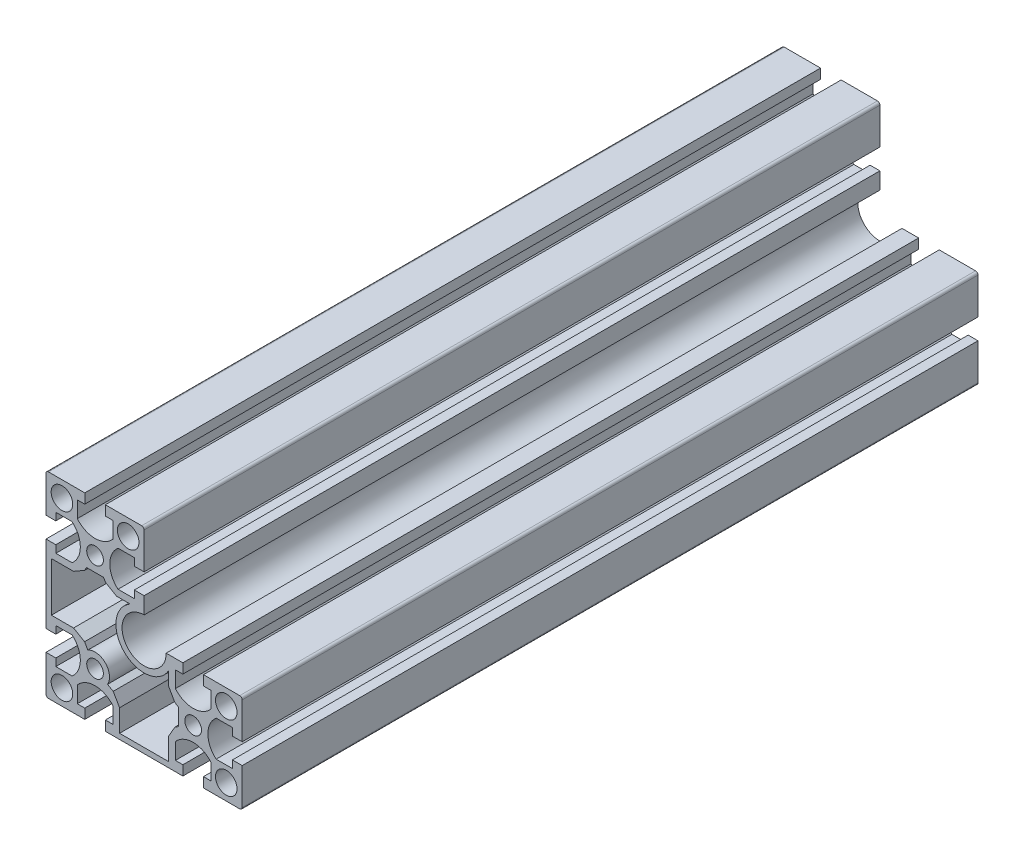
from build123d import *

# Parameters (mm, degrees)
MODEL_R         = 4.4
MODEL_R_2       = 3.4
EXTRUDE_1_DEPTH = 300


with BuildPart() as part:
    # Model → Extrude 1 (new body)
    with BuildSketch(Plane.XY):
        with BuildLine():
            Line((1530.933788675, 813.784756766), (1533.983788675, 813.784756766))
            Line((1533.983788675, 813.784756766), (1533.983788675, 817.784756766))
            Line((1533.983788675, 817.784756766), (1527.183788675, 817.784756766))
            ThreePointArc((1527.183788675, 817.784756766), (1511.819827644, 811.420795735), (1518.183788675, 826.784756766))
            Line((1518.183788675, 826.784756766), (1518.183788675, 833.584756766))
            Line((1518.183788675, 833.584756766), (1514.183788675, 833.584756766))
            Line((1514.183788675, 833.584756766), (1514.183788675, 830.534756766))
            Line((1514.183788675, 830.534756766), (1507.544774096, 830.534756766))
            ThreePointArc((1507.544774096, 830.534756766), (1504.183788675, 837.784756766), (1507.544774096, 845.034756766))
            Line((1507.544774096, 845.034756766), (1514.183788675, 845.034756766))
            Line((1514.183788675, 845.034756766), (1514.183788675, 841.984756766))
            Line((1514.183788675, 841.984756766), (1518.183788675, 841.984756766))
            Line((1518.183788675, 841.984756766), (1518.183788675, 856.784756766))
            ThreePointArc((1518.183788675, 856.784756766), (1517.890895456, 857.491863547), (1517.183788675, 857.784756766))
            Line((1517.183788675, 857.784756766), (1502.383788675, 857.784756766))
            Line((1502.383788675, 857.784756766), (1502.383788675, 853.784756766))
            Line((1502.383788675, 853.784756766), (1505.433788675, 853.784756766))
            Line((1505.433788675, 853.784756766), (1505.433788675, 847.145742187))
            ThreePointArc((1505.433788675, 847.145742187), (1498.183788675, 843.784756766), (1490.933788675, 847.145742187))
            Line((1490.933788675, 847.145742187), (1490.933788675, 853.784756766))
            Line((1490.933788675, 853.784756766), (1493.983788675, 853.784756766))
            Line((1493.983788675, 853.784756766), (1493.983788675, 857.784756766))
            Line((1493.983788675, 857.784756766), (1479.183788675, 857.784756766))
            ThreePointArc((1479.183788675, 857.784756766), (1478.476681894, 857.491863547), (1478.183788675, 856.784756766))
            Line((1478.183788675, 856.784756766), (1478.183788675, 841.984756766))
            Line((1478.183788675, 841.984756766), (1482.183788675, 841.984756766))
            Line((1482.183788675, 841.984756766), (1482.183788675, 845.034756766))
            Line((1482.183788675, 845.034756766), (1488.822803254, 845.034756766))
            ThreePointArc((1488.822803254, 845.034756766), (1492.183788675, 837.784756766), (1488.822803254, 830.534756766))
            Line((1488.822803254, 830.534756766), (1482.183788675, 830.534756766))
            Line((1482.183788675, 830.534756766), (1482.183788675, 833.584756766))
            Line((1482.183788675, 833.584756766), (1478.183788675, 833.584756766))
            Line((1478.183788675, 833.584756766), (1478.183788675, 801.984756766))
            Line((1478.183788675, 801.984756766), (1482.183788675, 801.984756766))
            Line((1482.183788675, 801.984756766), (1482.183788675, 805.034756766))
            Line((1482.183788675, 805.034756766), (1488.822803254, 805.034756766))
            ThreePointArc((1488.822803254, 805.034756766), (1492.183788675, 797.784756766), (1488.822803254, 790.534756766))
            Line((1488.822803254, 790.534756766), (1482.183788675, 790.534756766))
            Line((1482.183788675, 790.534756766), (1482.183788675, 793.584756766))
            Line((1482.183788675, 793.584756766), (1478.183788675, 793.584756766))
            Line((1478.183788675, 793.584756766), (1478.183788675, 778.784756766))
            ThreePointArc((1478.183788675, 778.784756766), (1478.476681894, 778.077649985), (1479.183788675, 777.784756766))
            Line((1479.183788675, 777.784756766), (1493.983788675, 777.784756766))
            Line((1493.983788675, 777.784756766), (1493.983788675, 781.784756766))
            Line((1493.983788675, 781.784756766), (1490.933788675, 781.784756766))
            Line((1490.933788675, 781.784756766), (1490.933788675, 788.423771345))
            ThreePointArc((1490.933788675, 788.423771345), (1498.183788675, 791.784756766), (1505.433788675, 788.423771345))
            Line((1505.433788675, 788.423771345), (1505.433788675, 781.784756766))
            Line((1505.433788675, 781.784756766), (1502.383788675, 781.784756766))
            Line((1502.383788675, 781.784756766), (1502.383788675, 777.784756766))
            Line((1502.383788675, 777.784756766), (1533.983788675, 777.784756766))
            Line((1533.983788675, 777.784756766), (1533.983788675, 781.784756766))
            Line((1533.983788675, 781.784756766), (1530.933788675, 781.784756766))
            Line((1530.933788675, 781.784756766), (1530.933788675, 788.423771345))
            ThreePointArc((1530.933788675, 788.423771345), (1538.183788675, 791.784756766), (1545.433788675, 788.423771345))
            Line((1545.433788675, 788.423771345), (1545.433788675, 781.784756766))
            Line((1545.433788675, 781.784756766), (1542.383788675, 781.784756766))
            Line((1542.383788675, 781.784756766), (1542.383788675, 777.784756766))
            Line((1542.383788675, 777.784756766), (1557.183788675, 777.784756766))
            ThreePointArc((1557.183788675, 777.784756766), (1557.890895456, 778.077649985), (1558.183788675, 778.784756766))
            Line((1558.183788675, 778.784756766), (1558.183788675, 793.584756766))
            Line((1558.183788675, 793.584756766), (1554.183788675, 793.584756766))
            Line((1554.183788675, 793.584756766), (1554.183788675, 790.534756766))
            Line((1554.183788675, 790.534756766), (1547.544774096, 790.534756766))
            ThreePointArc((1547.544774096, 790.534756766), (1544.183788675, 797.784756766), (1547.544774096, 805.034756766))
            Line((1547.544774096, 805.034756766), (1554.183788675, 805.034756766))
            Line((1554.183788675, 805.034756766), (1554.183788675, 801.984756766))
            Line((1554.183788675, 801.984756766), (1558.183788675, 801.984756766))
            Line((1558.183788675, 801.984756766), (1558.183788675, 816.784756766))
            ThreePointArc((1558.183788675, 816.784756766), (1557.890895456, 817.491863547), (1557.183788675, 817.784756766))
            Line((1557.183788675, 817.784756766), (1542.383788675, 817.784756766))
            Line((1542.383788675, 817.784756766), (1542.383788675, 813.784756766))
            Line((1542.383788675, 813.784756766), (1545.433788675, 813.784756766))
            Line((1545.433788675, 813.784756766), (1545.433788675, 807.145742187))
            ThreePointArc((1545.433788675, 807.145742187), (1538.183788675, 803.784756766), (1530.933788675, 807.145742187))
            Line((1530.933788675, 807.145742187), (1530.933788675, 813.784756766))
        make_face()
        with Locations((1551.683788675, 811.284756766)):
            Circle(MODEL_R, mode=Mode.SUBTRACT)
        with Locations((1551.683788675, 784.284756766)):
            Circle(MODEL_R, mode=Mode.SUBTRACT)
        with Locations((1484.683788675, 784.284756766)):
            Circle(MODEL_R, mode=Mode.SUBTRACT)
        with Locations((1484.683788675, 851.284756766)):
            Circle(MODEL_R, mode=Mode.SUBTRACT)
        with Locations((1511.683788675, 851.284756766)):
            Circle(MODEL_R, mode=Mode.SUBTRACT)
        with Locations((1538.183788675, 797.784756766)):
            Circle(MODEL_R_2, mode=Mode.SUBTRACT)
        with Locations((1498.183788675, 797.784756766)):
            Circle(MODEL_R_2, mode=Mode.SUBTRACT)
        with Locations((1498.183788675, 837.784756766)):
            Circle(MODEL_R_2, mode=Mode.SUBTRACT)
        with BuildLine():
            Line((1528.183788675, 789.011254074), (1530.781864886, 793.511254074))
            Line((1530.781864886, 793.511254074), (1532.183788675, 794.320655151))
            Line((1532.183788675, 794.320655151), (1532.183788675, 801.248858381))
            Line((1532.183788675, 801.248858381), (1530.781864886, 802.058259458))
            Line((1530.781864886, 802.058259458), (1528.183788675, 806.558259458))
            Line((1528.183788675, 806.558259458), (1528.183788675, 812.10584842))
            ThreePointArc((1528.183788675, 812.10584842), (1510.052060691, 809.653028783), (1512.504880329, 827.784756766))
            Line((1512.504880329, 827.784756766), (1506.957291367, 827.784756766))
            Line((1506.957291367, 827.784756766), (1502.457291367, 830.382832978))
            Line((1502.457291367, 830.382832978), (1501.64789029, 831.784756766))
            Line((1501.64789029, 831.784756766), (1494.71968706, 831.784756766))
            Line((1494.71968706, 831.784756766), (1493.910285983, 830.382832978))
            Line((1493.910285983, 830.382832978), (1489.410285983, 827.784756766))
            Line((1489.410285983, 827.784756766), (1480.383788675, 827.784756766))
            Line((1480.383788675, 827.784756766), (1480.383788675, 807.784756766))
            Line((1480.383788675, 807.784756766), (1489.410285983, 807.784756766))
            Line((1489.410285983, 807.784756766), (1493.910285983, 805.186680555))
            Line((1493.910285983, 805.186680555), (1495.233788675, 802.894306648))
            ThreePointArc((1495.233788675, 802.894306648), (1502.355718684, 801.956686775), (1503.293338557, 794.834756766))
            Line((1503.293338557, 794.834756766), (1505.585712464, 793.511254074))
            Line((1505.585712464, 793.511254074), (1508.183788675, 789.011254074))
            Line((1508.183788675, 789.011254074), (1508.183788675, 779.984756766))
            Line((1508.183788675, 779.984756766), (1528.183788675, 779.984756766))
            Line((1528.183788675, 779.984756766), (1528.183788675, 789.011254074))
        make_face(mode=Mode.SUBTRACT)
    extrude(amount=EXTRUDE_1_DEPTH)


solid = part.part
